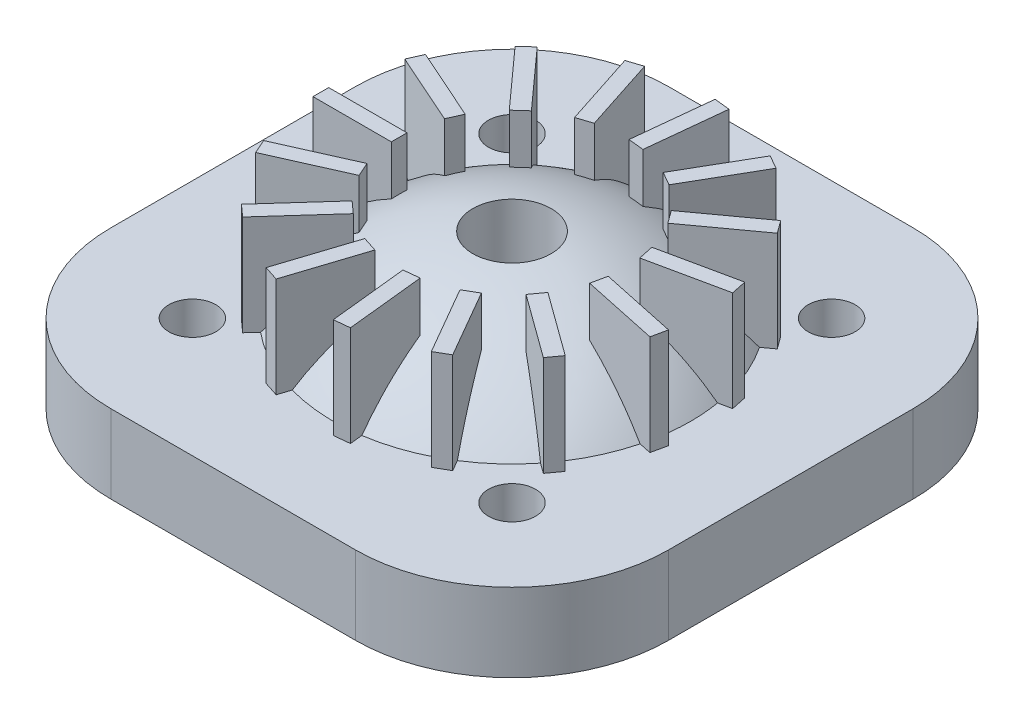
from build123d import *

# Parameters (mm, degrees)
BOSS_EXTRUDE1_DEPTH = 25
SKETCH6_R           = 45
SKETCH6_R_2         = 7.5
BOSS_EXTRUDE2_DEPTH = 6.5
SKETCH10_R          = 7.5
SKETCH10_R_2        = 12.5
CUT_EXTRUDE1_DEPTH  = 138.965808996
BOSS_EXTRUDE3_REACH = 142.976
SKETCH11_W          = 25
SKETCH11_H          = 5
CIRPATTERN1_COUNT   = 15


with BuildPart() as part:
    # Sketch1 → Boss-Extrude1 (new body)
    with BuildSketch(Plane(origin=(0, 0, 0), x_dir=(1, 0, 0), z_dir=(0, 1, 0))):
        with BuildLine():
            Line((-39, 89), (39, 89))
            ThreePointArc((39, 89), (74.355339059, 74.355339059), (89, 39))
            Line((89, 39), (89, -39))
            ThreePointArc((89, -39), (74.355339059, -74.355339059), (39, -89))
            Line((39, -89), (-39, -89))
            ThreePointArc((-39, -89), (-74.355339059, -74.355339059), (-89, -39))
            Line((-89, -39), (-89, 39))
            ThreePointArc((-89, 39), (-74.355339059, 74.355339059), (-39, 89))
        make_face()
    extrude(amount=BOSS_EXTRUDE1_DEPTH)

    # Sketch6 → Boss-Extrude2 (add)
    with BuildSketch(Plane.XZ):
        with BuildLine():
            ThreePointArc((61.198182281, 44.675675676), (59.485281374, 59.485281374), (44.675675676, 61.198182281))
            ThreePointArc((44.675675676, 61.198182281), (35.807754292, 57.818326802), (26.319078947, 57.987125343))
            ThreePointArc((26.319078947, 57.987125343), (0, 60.744193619), (-26.319078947, 57.987125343))
            ThreePointArc((-26.319078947, 57.987125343), (-35.807754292, 57.818326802), (-44.675675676, 61.198182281))
            ThreePointArc((-44.675675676, 61.198182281), (-59.485281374, 59.485281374), (-61.198182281, 44.675675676))
            ThreePointArc((-61.198182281, 44.675675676), (-57.818326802, 35.807754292), (-57.987125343, 26.319078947))
            ThreePointArc((-57.987125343, 26.319078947), (-60.744193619, 0), (-57.987125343, -26.319078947))
            ThreePointArc((-57.987125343, -26.319078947), (-57.818326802, -35.807754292), (-61.198182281, -44.675675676))
            ThreePointArc((-61.198182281, -44.675675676), (-59.485281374, -59.485281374), (-44.675675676, -61.198182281))
            ThreePointArc((-44.675675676, -61.198182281), (-35.807754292, -57.818326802), (-26.319078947, -57.987125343))
            ThreePointArc((-26.319078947, -57.987125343), (0, -60.744193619), (26.319078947, -57.987125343))
            ThreePointArc((26.319078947, -57.987125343), (35.807754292, -57.818326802), (44.675675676, -61.198182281))
            ThreePointArc((44.675675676, -61.198182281), (59.485281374, -59.485281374), (61.198182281, -44.675675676))
            ThreePointArc((61.198182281, -44.675675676), (57.818326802, -35.807754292), (57.987125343, -26.319078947))
            ThreePointArc((57.987125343, -26.319078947), (60.744193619, 0), (57.987125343, 26.319078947))
            ThreePointArc((57.987125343, 26.319078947), (57.818326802, 35.807754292), (61.198182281, 44.675675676))
        make_face()
        with Locations(Location((0, 0, 0), (0, 0, 90))):
            Circle(SKETCH6_R, mode=Mode.SUBTRACT)
        with Locations(Location((51, 51, 0), (0, 0, 90))):
            Circle(SKETCH6_R_2, mode=Mode.SUBTRACT)
        with Locations(Location((-51, 51, 0), (0, 0, 90))):
            Circle(SKETCH6_R_2, mode=Mode.SUBTRACT)
        with Locations(Location((-51, -51, 0), (0, 0, 90))):
            Circle(SKETCH6_R_2, mode=Mode.SUBTRACT)
        with Locations(Location((51, -51, 0), (0, 0, 90))):
            Circle(SKETCH6_R_2, mode=Mode.SUBTRACT)
    extrude(amount=BOSS_EXTRUDE2_DEPTH)

    # Sketch7 → Revolve1 (revolve)
    with BuildSketch(Plane.XY):
        with BuildLine():
            Line((0, 25), (0, 50))
            ThreePointArc((0, 50), (31.176616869, 43.602686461), (57, 25))
            Line((57, 25), (0, 25))
        make_face()
    revolve(axis=Axis((0, 25, 0), (0, 1, 0)))

    # Sketch8 → Cut-Revolve1 (revolve, cut)
    with BuildSketch(Plane.XY):
        with BuildLine():
            Line((0, -6.5), (0, 18.5))
            ThreePointArc((0, 18.5), (31.176616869, 12.102686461), (57, -6.5))
            Line((57, -6.5), (0, -6.5))
        make_face()
    revolve(axis=Axis((0, -6.5, 0), (0, 1, 0)), mode=Mode.SUBTRACT)

    # Sketch10 → Cut-Extrude1 (cut, through all)
    with BuildSketch(Plane.XZ.offset(6.5)):
        with Locations(Location((-51, 51, 0), (0, 0, 90))):
            Circle(SKETCH10_R)
        with Locations(Location((-51, -51, 0), (0, 0, 90))):
            Circle(SKETCH10_R)
        with Locations(Location((51, -51, 0), (0, 0, 90))):
            Circle(SKETCH10_R)
        with Locations(Location((51, 51, 0), (0, 0, 90))):
            Circle(SKETCH10_R)
        with Locations(Location((0, 0, 0), (0, 0, 270))):
            Circle(SKETCH10_R_2)
    extrude(amount=-CUT_EXTRUDE1_DEPTH, mode=Mode.SUBTRACT)

    # Sketch11 → Boss-Extrude3 (add, up to next)
    with BuildSketch(Plane(origin=(0, 57, 0), x_dir=(1, 0, 0), z_dir=(0, 1, 0)), mode=Mode.PRIVATE) as boss_extrude3_sk1:
        with Locations((-48.5, 0)):
            Rectangle(SKETCH11_W, SKETCH11_H)
    boss_extrude3_tool1 = extrude(boss_extrude3_sk1.sketch, amount=-BOSS_EXTRUDE3_REACH, mode=Mode.PRIVATE) - part.part
    boss_extrude3 = boss_extrude3_tool1.solids().sort_by_distance((-48.5, 57, 0))[0]
    add(boss_extrude3)

    # CirPattern1: Boss-Extrude3 ×15 about axis
    cirpattern1_axis = Axis((0, 0, 0), (0, 1, 0))
    for i in range(1, CIRPATTERN1_COUNT):
        add(boss_extrude3.rotate(cirpattern1_axis, i * 360 / CIRPATTERN1_COUNT))


solid = part.part
